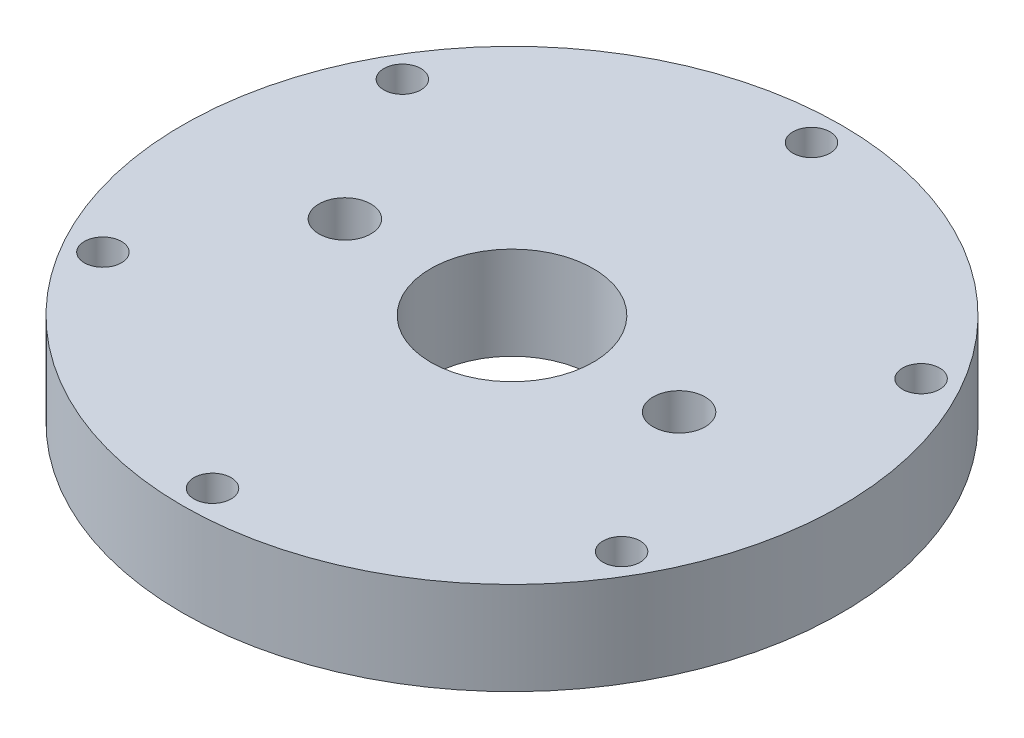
ISO-10303-21;
HEADER;
FILE_DESCRIPTION(('STEP AP214'),'2;1');
FILE_NAME('part.step','',(''),(''),'','','');
FILE_SCHEMA(('AUTOMOTIVE_DESIGN { 1 0 10303 214 1 1 1 1 }'));
ENDSEC;
DATA;
#1=APPLICATION_CONTEXT('core data for automotive mechanical design processes');
#2=APPLICATION_PROTOCOL_DEFINITION('international standard','automotive_design',2000,#1);
#3=PRODUCT_CONTEXT('',#1,'mechanical');
#4=PRODUCT('Part','Part','',(#3));
#5=PRODUCT_RELATED_PRODUCT_CATEGORY('part','',(#4));
#6=PRODUCT_DEFINITION_FORMATION('','',#4);
#7=PRODUCT_DEFINITION_CONTEXT('part definition',#1,'design');
#8=PRODUCT_DEFINITION('design','',#6,#7);
#9=PRODUCT_DEFINITION_SHAPE('','',#8);
#10=(LENGTH_UNIT() NAMED_UNIT(*) SI_UNIT(.MILLI.,.METRE.));
#11=(NAMED_UNIT(*) PLANE_ANGLE_UNIT() SI_UNIT($,.RADIAN.));
#12=(NAMED_UNIT(*) SI_UNIT($,.STERADIAN.) SOLID_ANGLE_UNIT());
#13=UNCERTAINTY_MEASURE_WITH_UNIT(LENGTH_MEASURE(1.E-05),#10,'distance_accuracy_value','');
#14=(GEOMETRIC_REPRESENTATION_CONTEXT(3) GLOBAL_UNCERTAINTY_ASSIGNED_CONTEXT((#13)) GLOBAL_UNIT_ASSIGNED_CONTEXT((#10,
#11,#12)) REPRESENTATION_CONTEXT('',''));
#15=CARTESIAN_POINT('',(0.,0.,0.));
#16=DIRECTION('',(0.,0.,1.));
#17=DIRECTION('',(1.,0.,0.));
#18=AXIS2_PLACEMENT_3D('',#15,#16,#17);
#19=CARTESIAN_POINT('',(0.,6.35,0.));
#20=DIRECTION('',(0.,1.,0.));
#21=DIRECTION('',(0.,0.,1.));
#22=AXIS2_PLACEMENT_3D('',#19,#20,#21);
#23=PLANE('',#22);
#24=CARTESIAN_POINT('',(-17.7406169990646,6.35,10.24255));
#25=DIRECTION('',(0.,1.,0.));
#26=DIRECTION('',(0.,0.,1.));
#27=AXIS2_PLACEMENT_3D('',#24,#25,#26);
#28=CIRCLE('',#27,1.27);
#29=CARTESIAN_POINT('',(-17.7406169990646,6.35,11.51255));
#30=VERTEX_POINT('',#29);
#31=EDGE_CURVE('E85',#30,#30,#28,.T.);
#32=ORIENTED_EDGE('',*,*,#31,.F.);
#33=EDGE_LOOP('',(#32));
#34=FACE_BOUND('',#33,.T.);
#35=CARTESIAN_POINT('',(17.7406169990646,6.35,10.24255));
#36=DIRECTION('',(0.,1.,0.));
#37=DIRECTION('',(0.,0.,1.));
#38=AXIS2_PLACEMENT_3D('',#35,#36,#37);
#39=CIRCLE('',#38,1.27);
#40=CARTESIAN_POINT('',(17.7406169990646,6.35,11.51255));
#41=VERTEX_POINT('',#40);
#42=EDGE_CURVE('E73',#41,#41,#39,.T.);
#43=ORIENTED_EDGE('',*,*,#42,.F.);
#44=EDGE_LOOP('',(#43));
#45=FACE_BOUND('',#44,.T.);
#46=CARTESIAN_POINT('',(11.43,6.35,0.));
#47=DIRECTION('',(0.,1.,0.));
#48=DIRECTION('',(0.,0.,1.));
#49=AXIS2_PLACEMENT_3D('',#46,#47,#48);
#50=CIRCLE('',#49,1.778);
#51=CARTESIAN_POINT('',(11.43,6.35,1.778));
#52=VERTEX_POINT('',#51);
#53=EDGE_CURVE('E61',#52,#52,#50,.T.);
#54=ORIENTED_EDGE('',*,*,#53,.F.);
#55=EDGE_LOOP('',(#54));
#56=FACE_BOUND('',#55,.T.);
#57=CARTESIAN_POINT('',(0.,6.35,-20.4851));
#58=DIRECTION('',(0.,1.,0.));
#59=DIRECTION('',(0.,0.,1.));
#60=AXIS2_PLACEMENT_3D('',#57,#58,#59);
#61=CIRCLE('',#60,1.27);
#62=CARTESIAN_POINT('',(0.,6.35,-19.2151));
#63=VERTEX_POINT('',#62);
#64=EDGE_CURVE('E49',#63,#63,#61,.T.);
#65=ORIENTED_EDGE('',*,*,#64,.F.);
#66=EDGE_LOOP('',(#65));
#67=FACE_BOUND('',#66,.T.);
#68=CARTESIAN_POINT('',(0.,6.35,0.));
#69=DIRECTION('',(0.,1.,0.));
#70=DIRECTION('',(0.,0.,1.));
#71=AXIS2_PLACEMENT_3D('',#68,#69,#70);
#72=CIRCLE('',#71,22.5425);
#73=CARTESIAN_POINT('',(0.,6.35,22.5425));
#74=VERTEX_POINT('',#73);
#75=EDGE_CURVE('E10',#74,#74,#72,.T.);
#76=ORIENTED_EDGE('',*,*,#75,.T.);
#77=EDGE_LOOP('',(#76));
#78=FACE_BOUND('',#77,.T.);
#79=CARTESIAN_POINT('',(0.,6.35,0.));
#80=DIRECTION('',(0.,1.,0.));
#81=DIRECTION('',(0.,0.,1.));
#82=AXIS2_PLACEMENT_3D('',#79,#80,#81);
#83=CIRCLE('',#82,5.55625);
#84=CARTESIAN_POINT('',(0.,6.35,5.55625));
#85=VERTEX_POINT('',#84);
#86=EDGE_CURVE('E44',#85,#85,#83,.T.);
#87=ORIENTED_EDGE('',*,*,#86,.F.);
#88=EDGE_LOOP('',(#87));
#89=FACE_BOUND('',#88,.T.);
#90=CARTESIAN_POINT('',(-11.43,6.35,0.));
#91=DIRECTION('',(0.,1.,0.));
#92=DIRECTION('',(0.,0.,1.));
#93=AXIS2_PLACEMENT_3D('',#90,#91,#92);
#94=CIRCLE('',#93,1.778);
#95=CARTESIAN_POINT('',(-11.43,6.35,1.778));
#96=VERTEX_POINT('',#95);
#97=EDGE_CURVE('E55',#96,#96,#94,.T.);
#98=ORIENTED_EDGE('',*,*,#97,.F.);
#99=EDGE_LOOP('',(#98));
#100=FACE_BOUND('',#99,.T.);
#101=CARTESIAN_POINT('',(17.7406169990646,6.35,-10.24255));
#102=DIRECTION('',(0.,1.,0.));
#103=DIRECTION('',(0.,0.,1.));
#104=AXIS2_PLACEMENT_3D('',#101,#102,#103);
#105=CIRCLE('',#104,1.27);
#106=CARTESIAN_POINT('',(17.7406169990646,6.35,-8.97255000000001));
#107=VERTEX_POINT('',#106);
#108=EDGE_CURVE('E67',#107,#107,#105,.T.);
#109=ORIENTED_EDGE('',*,*,#108,.F.);
#110=EDGE_LOOP('',(#109));
#111=FACE_BOUND('',#110,.T.);
#112=CARTESIAN_POINT('',(0.,6.35,20.4851));
#113=DIRECTION('',(0.,1.,0.));
#114=DIRECTION('',(0.,0.,1.));
#115=AXIS2_PLACEMENT_3D('',#112,#113,#114);
#116=CIRCLE('',#115,1.27);
#117=CARTESIAN_POINT('',(0.,6.35,21.7551));
#118=VERTEX_POINT('',#117);
#119=EDGE_CURVE('E79',#118,#118,#116,.T.);
#120=ORIENTED_EDGE('',*,*,#119,.F.);
#121=EDGE_LOOP('',(#120));
#122=FACE_BOUND('',#121,.T.);
#123=CARTESIAN_POINT('',(-17.7406169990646,6.35,-10.24255));
#124=DIRECTION('',(0.,1.,0.));
#125=DIRECTION('',(0.,0.,1.));
#126=AXIS2_PLACEMENT_3D('',#123,#124,#125);
#127=CIRCLE('',#126,1.27);
#128=CARTESIAN_POINT('',(-17.7406169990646,6.35,-8.97254999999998));
#129=VERTEX_POINT('',#128);
#130=EDGE_CURVE('E91',#129,#129,#127,.T.);
#131=ORIENTED_EDGE('',*,*,#130,.F.);
#132=EDGE_LOOP('',(#131));
#133=FACE_BOUND('',#132,.T.);
#134=ADVANCED_FACE('F33',(#34,#45,#56,#67,#78,#89,#100,#111,#122,#133),#23,.T.);
#135=CARTESIAN_POINT('',(0.,0.,0.));
#136=DIRECTION('',(0.,1.,0.));
#137=DIRECTION('',(0.,0.,1.));
#138=AXIS2_PLACEMENT_3D('',#135,#136,#137);
#139=PLANE('',#138);
#140=CARTESIAN_POINT('',(0.,0.,0.));
#141=DIRECTION('',(0.,1.,0.));
#142=DIRECTION('',(0.,0.,1.));
#143=AXIS2_PLACEMENT_3D('',#140,#141,#142);
#144=CIRCLE('',#143,22.5425);
#145=CARTESIAN_POINT('',(0.,0.,22.5425));
#146=VERTEX_POINT('',#145);
#147=EDGE_CURVE('E37',#146,#146,#144,.T.);
#148=ORIENTED_EDGE('',*,*,#147,.F.);
#149=EDGE_LOOP('',(#148));
#150=FACE_BOUND('',#149,.T.);
#151=CARTESIAN_POINT('',(0.,0.,0.));
#152=DIRECTION('',(0.,1.,0.));
#153=DIRECTION('',(0.,0.,1.));
#154=AXIS2_PLACEMENT_3D('',#151,#152,#153);
#155=CIRCLE('',#154,5.55625);
#156=CARTESIAN_POINT('',(0.,0.,5.55625));
#157=VERTEX_POINT('',#156);
#158=EDGE_CURVE('E46',#157,#157,#155,.T.);
#159=ORIENTED_EDGE('',*,*,#158,.T.);
#160=EDGE_LOOP('',(#159));
#161=FACE_BOUND('',#160,.T.);
#162=CARTESIAN_POINT('',(0.,0.,-20.4851));
#163=DIRECTION('',(0.,1.,0.));
#164=DIRECTION('',(0.,0.,1.));
#165=AXIS2_PLACEMENT_3D('',#162,#163,#164);
#166=CIRCLE('',#165,1.27);
#167=CARTESIAN_POINT('',(0.,0.,-19.2151));
#168=VERTEX_POINT('',#167);
#169=EDGE_CURVE('E52',#168,#168,#166,.T.);
#170=ORIENTED_EDGE('',*,*,#169,.T.);
#171=EDGE_LOOP('',(#170));
#172=FACE_BOUND('',#171,.T.);
#173=CARTESIAN_POINT('',(-11.43,0.,0.));
#174=DIRECTION('',(0.,1.,0.));
#175=DIRECTION('',(0.,0.,1.));
#176=AXIS2_PLACEMENT_3D('',#173,#174,#175);
#177=CIRCLE('',#176,1.778);
#178=CARTESIAN_POINT('',(-11.43,0.,1.778));
#179=VERTEX_POINT('',#178);
#180=EDGE_CURVE('E58',#179,#179,#177,.T.);
#181=ORIENTED_EDGE('',*,*,#180,.T.);
#182=EDGE_LOOP('',(#181));
#183=FACE_BOUND('',#182,.T.);
#184=CARTESIAN_POINT('',(11.43,0.,0.));
#185=DIRECTION('',(0.,1.,0.));
#186=DIRECTION('',(0.,0.,1.));
#187=AXIS2_PLACEMENT_3D('',#184,#185,#186);
#188=CIRCLE('',#187,1.778);
#189=CARTESIAN_POINT('',(11.43,0.,1.778));
#190=VERTEX_POINT('',#189);
#191=EDGE_CURVE('E64',#190,#190,#188,.T.);
#192=ORIENTED_EDGE('',*,*,#191,.T.);
#193=EDGE_LOOP('',(#192));
#194=FACE_BOUND('',#193,.T.);
#195=CARTESIAN_POINT('',(17.7406169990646,0.,-10.24255));
#196=DIRECTION('',(0.,1.,0.));
#197=DIRECTION('',(0.,0.,1.));
#198=AXIS2_PLACEMENT_3D('',#195,#196,#197);
#199=CIRCLE('',#198,1.27);
#200=CARTESIAN_POINT('',(17.7406169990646,0.,-8.97255000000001));
#201=VERTEX_POINT('',#200);
#202=EDGE_CURVE('E70',#201,#201,#199,.T.);
#203=ORIENTED_EDGE('',*,*,#202,.T.);
#204=EDGE_LOOP('',(#203));
#205=FACE_BOUND('',#204,.T.);
#206=CARTESIAN_POINT('',(17.7406169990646,0.,10.24255));
#207=DIRECTION('',(0.,1.,0.));
#208=DIRECTION('',(0.,0.,1.));
#209=AXIS2_PLACEMENT_3D('',#206,#207,#208);
#210=CIRCLE('',#209,1.27);
#211=CARTESIAN_POINT('',(17.7406169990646,0.,11.51255));
#212=VERTEX_POINT('',#211);
#213=EDGE_CURVE('E76',#212,#212,#210,.T.);
#214=ORIENTED_EDGE('',*,*,#213,.T.);
#215=EDGE_LOOP('',(#214));
#216=FACE_BOUND('',#215,.T.);
#217=CARTESIAN_POINT('',(0.,0.,20.4851));
#218=DIRECTION('',(0.,1.,0.));
#219=DIRECTION('',(0.,0.,1.));
#220=AXIS2_PLACEMENT_3D('',#217,#218,#219);
#221=CIRCLE('',#220,1.27);
#222=CARTESIAN_POINT('',(0.,0.,21.7551));
#223=VERTEX_POINT('',#222);
#224=EDGE_CURVE('E82',#223,#223,#221,.T.);
#225=ORIENTED_EDGE('',*,*,#224,.T.);
#226=EDGE_LOOP('',(#225));
#227=FACE_BOUND('',#226,.T.);
#228=CARTESIAN_POINT('',(-17.7406169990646,0.,10.24255));
#229=DIRECTION('',(0.,1.,0.));
#230=DIRECTION('',(0.,0.,1.));
#231=AXIS2_PLACEMENT_3D('',#228,#229,#230);
#232=CIRCLE('',#231,1.27);
#233=CARTESIAN_POINT('',(-17.7406169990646,0.,11.51255));
#234=VERTEX_POINT('',#233);
#235=EDGE_CURVE('E88',#234,#234,#232,.T.);
#236=ORIENTED_EDGE('',*,*,#235,.T.);
#237=EDGE_LOOP('',(#236));
#238=FACE_BOUND('',#237,.T.);
#239=CARTESIAN_POINT('',(-17.7406169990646,0.,-10.24255));
#240=DIRECTION('',(0.,1.,0.));
#241=DIRECTION('',(0.,0.,1.));
#242=AXIS2_PLACEMENT_3D('',#239,#240,#241);
#243=CIRCLE('',#242,1.27);
#244=CARTESIAN_POINT('',(-17.7406169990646,0.,-8.97254999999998));
#245=VERTEX_POINT('',#244);
#246=EDGE_CURVE('E94',#245,#245,#243,.T.);
#247=ORIENTED_EDGE('',*,*,#246,.T.);
#248=EDGE_LOOP('',(#247));
#249=FACE_BOUND('',#248,.T.);
#250=ADVANCED_FACE('F104',(#150,#161,#172,#183,#194,#205,#216,#227,#238,#249),#139,.F.);
#251=CARTESIAN_POINT('',(0.,6.35,0.));
#252=DIRECTION('',(0.,-1.,0.));
#253=DIRECTION('',(0.,0.,-1.));
#254=AXIS2_PLACEMENT_3D('',#251,#252,#253);
#255=CYLINDRICAL_SURFACE('',#254,22.5425);
#256=ORIENTED_EDGE('',*,*,#75,.F.);
#257=EDGE_LOOP('',(#256));
#258=FACE_BOUND('',#257,.T.);
#259=ORIENTED_EDGE('',*,*,#147,.T.);
#260=EDGE_LOOP('',(#259));
#261=FACE_BOUND('',#260,.T.);
#262=ADVANCED_FACE('F35',(#258,#261),#255,.T.);
#263=CARTESIAN_POINT('',(0.,6.35,0.));
#264=DIRECTION('',(0.,-1.,0.));
#265=DIRECTION('',(0.,0.,-1.));
#266=AXIS2_PLACEMENT_3D('',#263,#264,#265);
#267=CYLINDRICAL_SURFACE('',#266,5.55625);
#268=ORIENTED_EDGE('',*,*,#86,.T.);
#269=EDGE_LOOP('',(#268));
#270=FACE_BOUND('',#269,.T.);
#271=ORIENTED_EDGE('',*,*,#158,.F.);
#272=EDGE_LOOP('',(#271));
#273=FACE_BOUND('',#272,.T.);
#274=ADVANCED_FACE('F114',(#270,#273),#267,.F.);
#275=CARTESIAN_POINT('',(0.,6.35,-20.4851));
#276=DIRECTION('',(0.,-1.,0.));
#277=DIRECTION('',(0.,0.,-1.));
#278=AXIS2_PLACEMENT_3D('',#275,#276,#277);
#279=CYLINDRICAL_SURFACE('',#278,1.27);
#280=ORIENTED_EDGE('',*,*,#64,.T.);
#281=EDGE_LOOP('',(#280));
#282=FACE_BOUND('',#281,.T.);
#283=ORIENTED_EDGE('',*,*,#169,.F.);
#284=EDGE_LOOP('',(#283));
#285=FACE_BOUND('',#284,.T.);
#286=ADVANCED_FACE('F117',(#282,#285),#279,.F.);
#287=CARTESIAN_POINT('',(-11.43,6.35,0.));
#288=DIRECTION('',(0.,-1.,0.));
#289=DIRECTION('',(0.,0.,-1.));
#290=AXIS2_PLACEMENT_3D('',#287,#288,#289);
#291=CYLINDRICAL_SURFACE('',#290,1.778);
#292=ORIENTED_EDGE('',*,*,#97,.T.);
#293=EDGE_LOOP('',(#292));
#294=FACE_BOUND('',#293,.T.);
#295=ORIENTED_EDGE('',*,*,#180,.F.);
#296=EDGE_LOOP('',(#295));
#297=FACE_BOUND('',#296,.T.);
#298=ADVANCED_FACE('F121',(#294,#297),#291,.F.);
#299=CARTESIAN_POINT('',(11.43,6.35,0.));
#300=DIRECTION('',(0.,-1.,0.));
#301=DIRECTION('',(0.,0.,-1.));
#302=AXIS2_PLACEMENT_3D('',#299,#300,#301);
#303=CYLINDRICAL_SURFACE('',#302,1.778);
#304=ORIENTED_EDGE('',*,*,#53,.T.);
#305=EDGE_LOOP('',(#304));
#306=FACE_BOUND('',#305,.T.);
#307=ORIENTED_EDGE('',*,*,#191,.F.);
#308=EDGE_LOOP('',(#307));
#309=FACE_BOUND('',#308,.T.);
#310=ADVANCED_FACE('F125',(#306,#309),#303,.F.);
#311=CARTESIAN_POINT('',(17.7406169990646,6.35,-10.24255));
#312=DIRECTION('',(0.,-1.,0.));
#313=DIRECTION('',(0.,0.,-1.));
#314=AXIS2_PLACEMENT_3D('',#311,#312,#313);
#315=CYLINDRICAL_SURFACE('',#314,1.27);
#316=ORIENTED_EDGE('',*,*,#108,.T.);
#317=EDGE_LOOP('',(#316));
#318=FACE_BOUND('',#317,.T.);
#319=ORIENTED_EDGE('',*,*,#202,.F.);
#320=EDGE_LOOP('',(#319));
#321=FACE_BOUND('',#320,.T.);
#322=ADVANCED_FACE('F129',(#318,#321),#315,.F.);
#323=CARTESIAN_POINT('',(17.7406169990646,6.35,10.24255));
#324=DIRECTION('',(0.,-1.,0.));
#325=DIRECTION('',(0.,0.,-1.));
#326=AXIS2_PLACEMENT_3D('',#323,#324,#325);
#327=CYLINDRICAL_SURFACE('',#326,1.27);
#328=ORIENTED_EDGE('',*,*,#42,.T.);
#329=EDGE_LOOP('',(#328));
#330=FACE_BOUND('',#329,.T.);
#331=ORIENTED_EDGE('',*,*,#213,.F.);
#332=EDGE_LOOP('',(#331));
#333=FACE_BOUND('',#332,.T.);
#334=ADVANCED_FACE('F133',(#330,#333),#327,.F.);
#335=CARTESIAN_POINT('',(0.,6.35,20.4851));
#336=DIRECTION('',(0.,-1.,0.));
#337=DIRECTION('',(0.,0.,-1.));
#338=AXIS2_PLACEMENT_3D('',#335,#336,#337);
#339=CYLINDRICAL_SURFACE('',#338,1.27);
#340=ORIENTED_EDGE('',*,*,#119,.T.);
#341=EDGE_LOOP('',(#340));
#342=FACE_BOUND('',#341,.T.);
#343=ORIENTED_EDGE('',*,*,#224,.F.);
#344=EDGE_LOOP('',(#343));
#345=FACE_BOUND('',#344,.T.);
#346=ADVANCED_FACE('F137',(#342,#345),#339,.F.);
#347=CARTESIAN_POINT('',(-17.7406169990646,6.35,10.24255));
#348=DIRECTION('',(0.,-1.,0.));
#349=DIRECTION('',(0.,0.,-1.));
#350=AXIS2_PLACEMENT_3D('',#347,#348,#349);
#351=CYLINDRICAL_SURFACE('',#350,1.27);
#352=ORIENTED_EDGE('',*,*,#31,.T.);
#353=EDGE_LOOP('',(#352));
#354=FACE_BOUND('',#353,.T.);
#355=ORIENTED_EDGE('',*,*,#235,.F.);
#356=EDGE_LOOP('',(#355));
#357=FACE_BOUND('',#356,.T.);
#358=ADVANCED_FACE('F141',(#354,#357),#351,.F.);
#359=CARTESIAN_POINT('',(-17.7406169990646,6.35,-10.24255));
#360=DIRECTION('',(0.,-1.,0.));
#361=DIRECTION('',(0.,0.,-1.));
#362=AXIS2_PLACEMENT_3D('',#359,#360,#361);
#363=CYLINDRICAL_SURFACE('',#362,1.27);
#364=ORIENTED_EDGE('',*,*,#130,.T.);
#365=EDGE_LOOP('',(#364));
#366=FACE_BOUND('',#365,.T.);
#367=ORIENTED_EDGE('',*,*,#246,.F.);
#368=EDGE_LOOP('',(#367));
#369=FACE_BOUND('',#368,.T.);
#370=ADVANCED_FACE('F100',(#366,#369),#363,.F.);
#371=CLOSED_SHELL('',(#134,#250,#262,#274,#286,#298,#310,#322,#334,#346,#358,#370));
#372=MANIFOLD_SOLID_BREP('B2',#371);
#373=ADVANCED_BREP_SHAPE_REPRESENTATION('',(#18,#372),#14);
#374=SHAPE_DEFINITION_REPRESENTATION(#9,#373);
ENDSEC;
END-ISO-10303-21;
